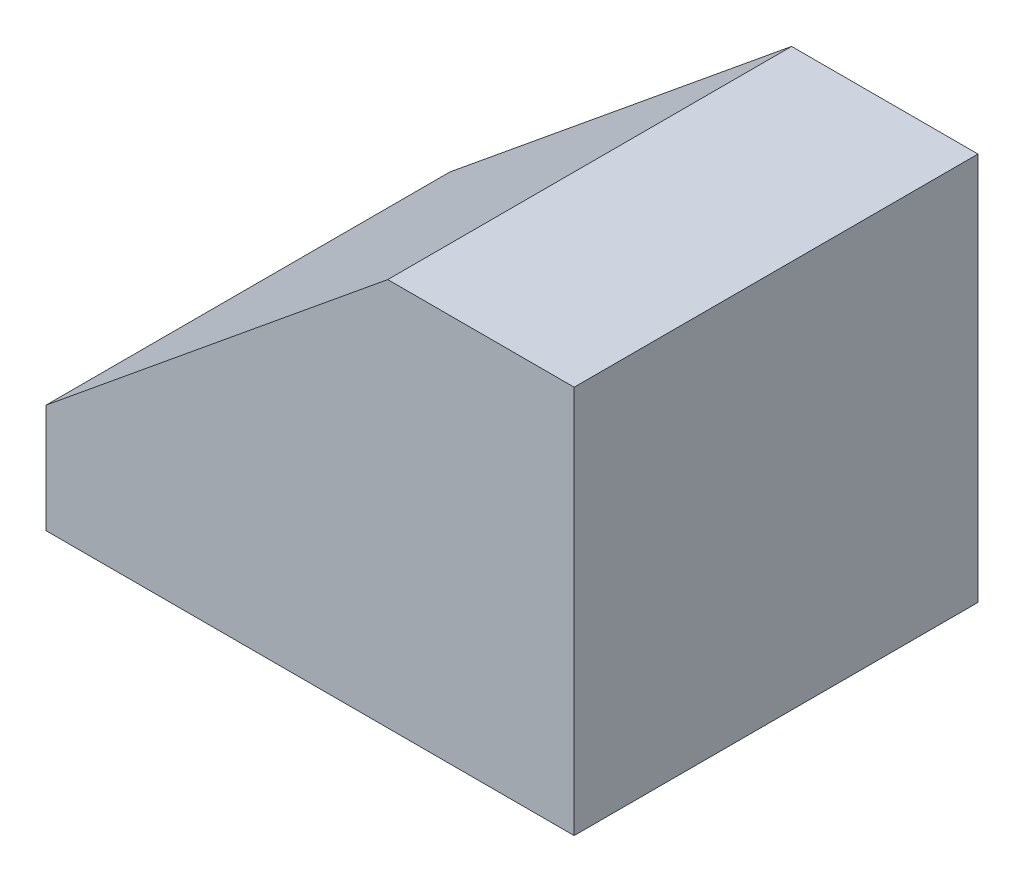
from build123d import *

# Parameters (mm, degrees)
SKETCH_1_W          = 68
SKETCH_1_H          = 52
EXTRUDE_1_DEPTH     = 50
CUT_EXTRUDE_1_DEPTH = 100.136269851


with BuildPart() as part:
    # Sketch 1 → Extrude 1 (new body)
    with BuildSketch(Plane(origin=(0, 0, 0), x_dir=(1, 0, 0), z_dir=(0, 1, 0))):
        with Locations((-34, -26)):
            Rectangle(SKETCH_1_W, SKETCH_1_H)
    extrude(amount=EXTRUDE_1_DEPTH)

    # Sketch 2 → Cut-Extrude 1 (cut, through all)
    with BuildSketch(Plane.XY):
        Polygon((-24, 50), (-68, 14), (-68, 50), align=None)
    extrude(amount=CUT_EXTRUDE_1_DEPTH, mode=Mode.SUBTRACT)


solid = part.part
